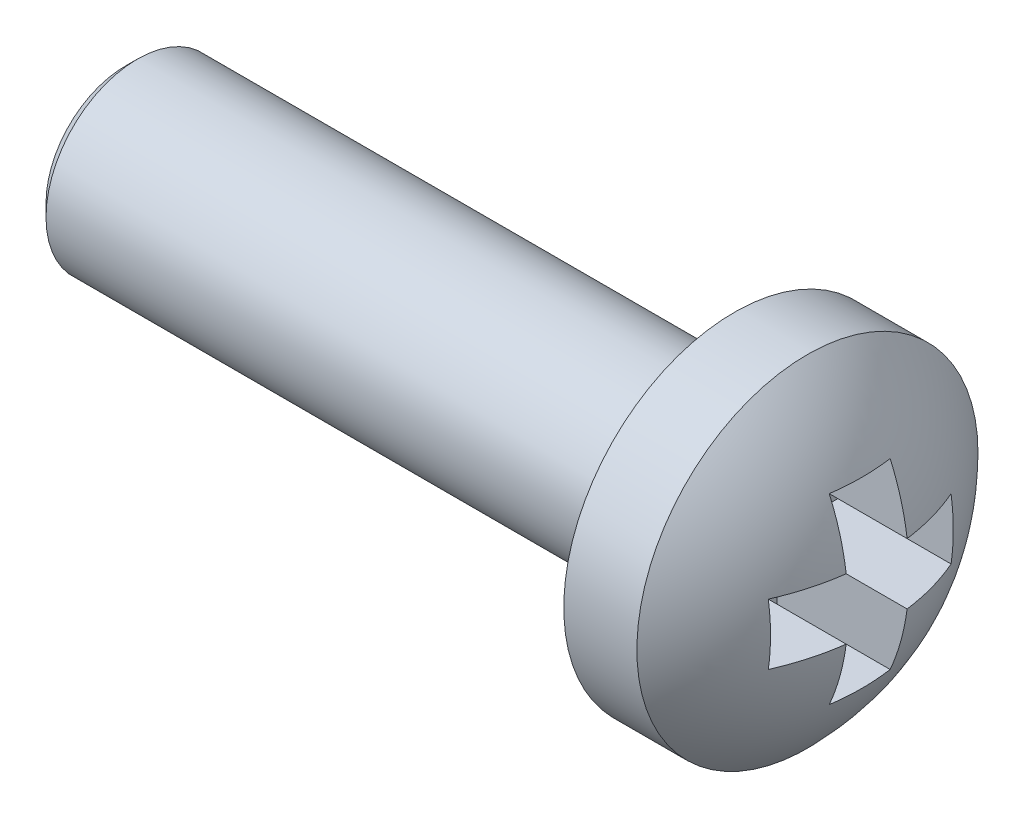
ISO-10303-21;
HEADER;
FILE_DESCRIPTION(('STEP AP214'),'2;1');
FILE_NAME('part.step','',(''),(''),'','','');
FILE_SCHEMA(('AUTOMOTIVE_DESIGN { 1 0 10303 214 1 1 1 1 }'));
ENDSEC;
DATA;
#1=APPLICATION_CONTEXT('core data for automotive mechanical design processes');
#2=APPLICATION_PROTOCOL_DEFINITION('international standard','automotive_design',2000,#1);
#3=PRODUCT_CONTEXT('',#1,'mechanical');
#4=PRODUCT('Part','Part','',(#3));
#5=PRODUCT_RELATED_PRODUCT_CATEGORY('part','',(#4));
#6=PRODUCT_DEFINITION_FORMATION('','',#4);
#7=PRODUCT_DEFINITION_CONTEXT('part definition',#1,'design');
#8=PRODUCT_DEFINITION('design','',#6,#7);
#9=PRODUCT_DEFINITION_SHAPE('','',#8);
#10=(LENGTH_UNIT() NAMED_UNIT(*) SI_UNIT(.MILLI.,.METRE.));
#11=(NAMED_UNIT(*) PLANE_ANGLE_UNIT() SI_UNIT($,.RADIAN.));
#12=(NAMED_UNIT(*) SI_UNIT($,.STERADIAN.) SOLID_ANGLE_UNIT());
#13=UNCERTAINTY_MEASURE_WITH_UNIT(LENGTH_MEASURE(1.E-05),#10,'distance_accuracy_value','');
#14=(GEOMETRIC_REPRESENTATION_CONTEXT(3) GLOBAL_UNCERTAINTY_ASSIGNED_CONTEXT((#13)) GLOBAL_UNIT_ASSIGNED_CONTEXT((#10,
#11,#12)) REPRESENTATION_CONTEXT('',''));
#15=CARTESIAN_POINT('',(0.,0.,0.));
#16=DIRECTION('',(0.,0.,1.));
#17=DIRECTION('',(1.,0.,0.));
#18=AXIS2_PLACEMENT_3D('',#15,#16,#17);
#19=CARTESIAN_POINT('',(2.4,0.,0.));
#20=CARTESIAN_POINT('',(2.4,-1.57169168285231,0.));
#21=CARTESIAN_POINT('',(1.2,-2.8,0.));
#22=B_SPLINE_CURVE_WITH_KNOTS('',2,(#19,#20,#21),.UNSPECIFIED.,.F.,.F.,(3,3),(0.,1.),.UNSPECIFIED.);
#23=CARTESIAN_POINT('',(11.0618266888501,0.,0.));
#24=DIRECTION('',(1.,0.,0.));
#25=AXIS1_PLACEMENT('',#23,#24);
#26=SURFACE_OF_REVOLUTION('',#22,#25);
#27=CARTESIAN_POINT('',(1.2,0.,0.));
#28=DIRECTION('',(1.,0.,0.));
#29=DIRECTION('',(0.,0.,-1.));
#30=AXIS2_PLACEMENT_3D('',#27,#28,#29);
#31=CIRCLE('',#30,2.8);
#32=CARTESIAN_POINT('',(1.2,0.,-2.8));
#33=VERTEX_POINT('',#32);
#34=EDGE_CURVE('E267',#33,#33,#31,.T.);
#35=ORIENTED_EDGE('',*,*,#34,.T.);
#36=EDGE_LOOP('',(#35));
#37=FACE_BOUND('',#36,.T.);
#38=CARTESIAN_POINT('',(2.05758661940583,0.500000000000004,1.49999999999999));
#39=CARTESIAN_POINT('',(2.08308448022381,0.500000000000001,1.44179657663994));
#40=CARTESIAN_POINT('',(2.10709470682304,0.5,1.38295700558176));
#41=CARTESIAN_POINT('',(2.1520554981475,0.5,1.26410705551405));
#42=CARTESIAN_POINT('',(2.17300544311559,0.5,1.204096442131));
#43=CARTESIAN_POINT('',(2.23082558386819,0.5,1.02342732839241));
#44=CARTESIAN_POINT('',(2.2630608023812,0.499999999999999,0.901232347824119));
#45=CARTESIAN_POINT('',(2.29852160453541,0.499999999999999,0.731861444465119));
#46=CARTESIAN_POINT('',(2.30725171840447,0.5,0.685768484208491));
#47=CARTESIAN_POINT('',(2.3229806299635,0.5,0.593159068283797));
#48=CARTESIAN_POINT('',(2.32997465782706,0.5,0.546641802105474));
#49=CARTESIAN_POINT('',(2.33609517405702,0.5,0.500000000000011));
#50=B_SPLINE_CURVE_WITH_KNOTS('',3,(#38,#39,#40,#41,#42,#43,#44,#45,#46,#47,#48,#49),
.UNSPECIFIED.,.F.,.F.,(4,2,2,2,2,4),(0.,0.190580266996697,0.381199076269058,0.759504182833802,
0.900218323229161,1.04131489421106),.UNSPECIFIED.);
#51=CARTESIAN_POINT('',(2.05758661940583,0.5,1.5));
#52=VERTEX_POINT('',#51);
#53=CARTESIAN_POINT('',(2.33609517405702,0.5,0.500000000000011));
#54=VERTEX_POINT('',#53);
#55=EDGE_CURVE('E169',#52,#54,#50,.T.);
#56=ORIENTED_EDGE('',*,*,#55,.T.);
#57=CARTESIAN_POINT('',(2.33609517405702,0.5,0.500000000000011));
#58=CARTESIAN_POINT('',(2.32797490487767,0.561927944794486,0.500000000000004));
#59=CARTESIAN_POINT('',(2.31830112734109,0.623654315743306,0.500000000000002));
#60=CARTESIAN_POINT('',(2.29584316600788,0.746540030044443,0.499999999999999));
#61=CARTESIAN_POINT('',(2.28305889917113,0.807699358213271,0.5));
#62=CARTESIAN_POINT('',(2.25447928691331,0.928850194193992,0.500000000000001));
#63=CARTESIAN_POINT('',(2.23870606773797,0.988846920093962,0.500000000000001));
#64=CARTESIAN_POINT('',(2.20412521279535,1.10795747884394,0.5));
#65=CARTESIAN_POINT('',(2.1853177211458,1.16707135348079,0.5));
#66=CARTESIAN_POINT('',(2.14895095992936,1.27208335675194,0.5));
#67=CARTESIAN_POINT('',(2.13194503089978,1.3181740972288,0.5));
#68=CARTESIAN_POINT('',(2.09611683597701,1.40963903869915,0.500000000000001));
#69=CARTESIAN_POINT('',(2.07729474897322,1.45501330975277,0.500000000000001));
#70=CARTESIAN_POINT('',(2.05758661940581,1.5,0.5));
#71=B_SPLINE_CURVE_WITH_KNOTS('',3,(#57,#58,#59,#60,#61,#62,#63,#64,#65,#66,#67,#68,#69,#70),
.UNSPECIFIED.,.F.,.F.,(4,2,2,2,2,2,4),(0.,0.187357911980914,0.374720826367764,0.560747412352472,
0.746765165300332,0.894111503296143,1.0414433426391),.UNSPECIFIED.);
#72=CARTESIAN_POINT('',(2.05758661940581,1.5,0.5));
#73=VERTEX_POINT('',#72);
#74=EDGE_CURVE('E11',#54,#73,#71,.T.);
#75=ORIENTED_EDGE('',*,*,#74,.T.);
#76=CARTESIAN_POINT('',(2.05758661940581,1.5,0.500000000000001));
#77=CARTESIAN_POINT('',(2.07601190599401,1.5,0.374107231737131));
#78=CARTESIAN_POINT('',(2.08741865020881,1.5,0.247173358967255));
#79=CARTESIAN_POINT('',(2.09618340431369,1.5,-0.00617564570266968));
#80=CARTESIAN_POINT('',(2.09365159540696,1.5,-0.132586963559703));
#81=CARTESIAN_POINT('',(2.07818848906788,1.5,-0.339263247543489));
#82=CARTESIAN_POINT('',(2.0693049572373,1.5,-0.419846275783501));
#83=CARTESIAN_POINT('',(2.05758661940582,1.5,-0.499999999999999));
#84=B_SPLINE_CURVE_WITH_KNOTS('',3,(#76,#77,#78,#79,#80,#81,#82,#83),.UNSPECIFIED.,.F.,.F.,(4,2,
2,4),(0.,0.381541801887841,0.760071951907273,1.00308018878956),.UNSPECIFIED.);
#85=CARTESIAN_POINT('',(2.05758661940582,1.5,-0.5));
#86=VERTEX_POINT('',#85);
#87=EDGE_CURVE('E47',#73,#86,#84,.T.);
#88=ORIENTED_EDGE('',*,*,#87,.T.);
#89=CARTESIAN_POINT('',(2.05758661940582,1.5,-0.499999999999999));
#90=CARTESIAN_POINT('',(2.08308448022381,1.44179657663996,-0.499999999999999));
#91=CARTESIAN_POINT('',(2.10709470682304,1.38295700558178,-0.5));
#92=CARTESIAN_POINT('',(2.1520554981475,1.26410705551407,-0.5));
#93=CARTESIAN_POINT('',(2.17300544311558,1.20409644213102,-0.5));
#94=CARTESIAN_POINT('',(2.23082558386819,1.02342732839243,-0.499999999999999));
#95=CARTESIAN_POINT('',(2.2630608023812,0.901232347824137,-0.499999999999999));
#96=CARTESIAN_POINT('',(2.29852160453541,0.731861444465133,-0.499999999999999));
#97=CARTESIAN_POINT('',(2.30725171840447,0.685768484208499,-0.499999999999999));
#98=CARTESIAN_POINT('',(2.3229806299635,0.593159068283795,-0.5));
#99=CARTESIAN_POINT('',(2.32997465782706,0.546641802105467,-0.5));
#100=CARTESIAN_POINT('',(2.33609517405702,0.5,-0.5));
#101=B_SPLINE_CURVE_WITH_KNOTS('',3,(#89,#90,#91,#92,#93,#94,#95,#96,#97,#98,#99,#100),
.UNSPECIFIED.,.F.,.F.,(4,2,2,2,2,4),(0.,0.190580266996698,0.381199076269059,0.759504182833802,
0.900218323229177,1.04131489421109),.UNSPECIFIED.);
#102=CARTESIAN_POINT('',(2.33609517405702,0.5,-0.5));
#103=VERTEX_POINT('',#102);
#104=EDGE_CURVE('E233',#86,#103,#101,.T.);
#105=ORIENTED_EDGE('',*,*,#104,.T.);
#106=CARTESIAN_POINT('',(2.33609517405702,0.5,-0.5));
#107=CARTESIAN_POINT('',(2.32797490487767,0.5,-0.561927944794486));
#108=CARTESIAN_POINT('',(2.31830112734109,0.5,-0.623654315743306));
#109=CARTESIAN_POINT('',(2.29584316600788,0.5,-0.746540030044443));
#110=CARTESIAN_POINT('',(2.28305889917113,0.5,-0.807699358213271));
#111=CARTESIAN_POINT('',(2.25447928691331,0.5,-0.928850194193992));
#112=CARTESIAN_POINT('',(2.23870606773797,0.5,-0.988846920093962));
#113=CARTESIAN_POINT('',(2.20412521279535,0.5,-1.10795747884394));
#114=CARTESIAN_POINT('',(2.1853177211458,0.5,-1.16707135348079));
#115=CARTESIAN_POINT('',(2.14895095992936,0.5,-1.27208335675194));
#116=CARTESIAN_POINT('',(2.13194503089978,0.5,-1.31817409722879));
#117=CARTESIAN_POINT('',(2.09611683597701,0.5,-1.40963903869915));
#118=CARTESIAN_POINT('',(2.07729474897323,0.5,-1.45501330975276));
#119=CARTESIAN_POINT('',(2.05758661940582,0.5,-1.49999999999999));
#120=B_SPLINE_CURVE_WITH_KNOTS('',3,(#106,#107,#108,#109,#110,#111,#112,#113,#114,#115,#116,
#117,#118,#119),.UNSPECIFIED.,.F.,.F.,(4,2,2,2,2,2,4),(0.,0.187357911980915,0.374720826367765,
0.560747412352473,0.746765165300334,0.894111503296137,1.04144334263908),.UNSPECIFIED.);
#121=CARTESIAN_POINT('',(2.05758661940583,0.5,-1.5));
#122=VERTEX_POINT('',#121);
#123=EDGE_CURVE('E227',#103,#122,#120,.T.);
#124=ORIENTED_EDGE('',*,*,#123,.T.);
#125=CARTESIAN_POINT('',(2.05758661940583,0.500000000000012,-1.49999999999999));
#126=CARTESIAN_POINT('',(2.07601190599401,0.374107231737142,-1.5));
#127=CARTESIAN_POINT('',(2.0874186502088,0.247173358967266,-1.5));
#128=CARTESIAN_POINT('',(2.09618340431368,-0.00617564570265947,-1.5));
#129=CARTESIAN_POINT('',(2.09365159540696,-0.132586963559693,-1.5));
#130=CARTESIAN_POINT('',(2.07818848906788,-0.339263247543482,-1.5));
#131=CARTESIAN_POINT('',(2.0693049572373,-0.419846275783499,-1.5));
#132=CARTESIAN_POINT('',(2.05758661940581,-0.500000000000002,-1.5));
#133=B_SPLINE_CURVE_WITH_KNOTS('',3,(#125,#126,#127,#128,#129,#130,#131,#132),.UNSPECIFIED.,.F.,
.F.,(4,2,2,4),(0.,0.38154180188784,0.760071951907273,1.00308018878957),.UNSPECIFIED.);
#134=CARTESIAN_POINT('',(2.05758661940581,-0.5,-1.5));
#135=VERTEX_POINT('',#134);
#136=EDGE_CURVE('E220',#122,#135,#133,.T.);
#137=ORIENTED_EDGE('',*,*,#136,.T.);
#138=CARTESIAN_POINT('',(2.05758661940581,-0.500000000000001,-1.5));
#139=CARTESIAN_POINT('',(2.0830844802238,-0.5,-1.44179657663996));
#140=CARTESIAN_POINT('',(2.10709470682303,-0.5,-1.38295700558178));
#141=CARTESIAN_POINT('',(2.1520554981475,-0.5,-1.26410705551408));
#142=CARTESIAN_POINT('',(2.17300544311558,-0.5,-1.20409644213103));
#143=CARTESIAN_POINT('',(2.23082558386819,-0.5,-1.02342732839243));
#144=CARTESIAN_POINT('',(2.2630608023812,-0.499999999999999,-0.901232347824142));
#145=CARTESIAN_POINT('',(2.29852160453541,-0.5,-0.731861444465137));
#146=CARTESIAN_POINT('',(2.30725171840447,-0.5,-0.685768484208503));
#147=CARTESIAN_POINT('',(2.3229806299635,-0.5,-0.593159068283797));
#148=CARTESIAN_POINT('',(2.32997465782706,-0.5,-0.546641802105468));
#149=CARTESIAN_POINT('',(2.33609517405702,-0.5,-0.5));
#150=B_SPLINE_CURVE_WITH_KNOTS('',3,(#138,#139,#140,#141,#142,#143,#144,#145,#146,#147,#148,
#149),.UNSPECIFIED.,.F.,.F.,(4,2,2,2,2,4),(0.,0.190580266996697,0.381199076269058,
0.759504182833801,0.900218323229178,1.0413148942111),.UNSPECIFIED.);
#151=CARTESIAN_POINT('',(2.33609517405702,-0.5,-0.5));
#152=VERTEX_POINT('',#151);
#153=EDGE_CURVE('E213',#135,#152,#150,.T.);
#154=ORIENTED_EDGE('',*,*,#153,.T.);
#155=CARTESIAN_POINT('',(2.33609517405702,-0.5,-0.5));
#156=CARTESIAN_POINT('',(2.32797490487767,-0.561927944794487,-0.5));
#157=CARTESIAN_POINT('',(2.31830112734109,-0.623654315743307,-0.5));
#158=CARTESIAN_POINT('',(2.29584316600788,-0.746540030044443,-0.5));
#159=CARTESIAN_POINT('',(2.28305889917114,-0.807699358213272,-0.5));
#160=CARTESIAN_POINT('',(2.25447928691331,-0.928850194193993,-0.5));
#161=CARTESIAN_POINT('',(2.23870606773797,-0.988846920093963,-0.5));
#162=CARTESIAN_POINT('',(2.20412521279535,-1.10795747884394,-0.5));
#163=CARTESIAN_POINT('',(2.1853177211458,-1.16707135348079,-0.5));
#164=CARTESIAN_POINT('',(2.14895095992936,-1.27208335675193,-0.5));
#165=CARTESIAN_POINT('',(2.13194503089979,-1.31817409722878,-0.5));
#166=CARTESIAN_POINT('',(2.09611683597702,-1.40963903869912,-0.499999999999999));
#167=CARTESIAN_POINT('',(2.07729474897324,-1.45501330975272,-0.499999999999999));
#168=CARTESIAN_POINT('',(2.05758661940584,-1.49999999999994,-0.499999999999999));
#169=B_SPLINE_CURVE_WITH_KNOTS('',3,(#155,#156,#157,#158,#159,#160,#161,#162,#163,#164,#165,
#166,#167,#168),.UNSPECIFIED.,.F.,.F.,(4,2,2,2,2,2,4),(0.,0.187357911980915,0.374720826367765,
0.560747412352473,0.746765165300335,0.894111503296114,1.04144334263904),.UNSPECIFIED.);
#170=CARTESIAN_POINT('',(2.05758661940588,-1.5,-0.5));
#171=VERTEX_POINT('',#170);
#172=EDGE_CURVE('E206',#152,#171,#169,.T.);
#173=ORIENTED_EDGE('',*,*,#172,.T.);
#174=CARTESIAN_POINT('',(2.05758661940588,-1.49999999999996,-0.499999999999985));
#175=CARTESIAN_POINT('',(2.07601190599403,-1.49999999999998,-0.374107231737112));
#176=CARTESIAN_POINT('',(2.08741865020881,-1.5,-0.247173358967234));
#177=CARTESIAN_POINT('',(2.09618340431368,-1.5,0.00617564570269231));
#178=CARTESIAN_POINT('',(2.09365159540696,-1.5,0.132586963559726));
#179=CARTESIAN_POINT('',(2.07818848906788,-1.5,0.339263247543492));
#180=CARTESIAN_POINT('',(2.06930495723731,-1.5,0.419846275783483));
#181=CARTESIAN_POINT('',(2.05758661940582,-1.5,0.499999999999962));
#182=B_SPLINE_CURVE_WITH_KNOTS('',3,(#174,#175,#176,#177,#178,#179,#180,#181),.UNSPECIFIED.,.F.,
.F.,(4,2,2,4),(0.,0.38154180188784,0.760071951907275,1.0030801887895),.UNSPECIFIED.);
#183=CARTESIAN_POINT('',(2.05758661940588,-1.5,0.5));
#184=VERTEX_POINT('',#183);
#185=EDGE_CURVE('E199',#171,#184,#182,.T.);
#186=ORIENTED_EDGE('',*,*,#185,.T.);
#187=CARTESIAN_POINT('',(2.05758661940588,-1.49999999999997,0.499999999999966));
#188=CARTESIAN_POINT('',(2.08308448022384,-1.44179657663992,0.499999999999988));
#189=CARTESIAN_POINT('',(2.10709470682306,-1.38295700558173,0.499999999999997));
#190=CARTESIAN_POINT('',(2.15205549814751,-1.26410705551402,0.500000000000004));
#191=CARTESIAN_POINT('',(2.1730054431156,-1.20409644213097,0.500000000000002));
#192=CARTESIAN_POINT('',(2.2308255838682,-1.02342732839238,0.499999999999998));
#193=CARTESIAN_POINT('',(2.26306080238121,-0.901232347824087,0.499999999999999));
#194=CARTESIAN_POINT('',(2.29852160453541,-0.73186144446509,0.5));
#195=CARTESIAN_POINT('',(2.30725171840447,-0.685768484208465,0.5));
#196=CARTESIAN_POINT('',(2.3229806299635,-0.593159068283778,0.500000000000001));
#197=CARTESIAN_POINT('',(2.32997465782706,-0.546641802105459,0.500000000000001));
#198=CARTESIAN_POINT('',(2.33609517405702,-0.5,0.5));
#199=B_SPLINE_CURVE_WITH_KNOTS('',3,(#187,#188,#189,#190,#191,#192,#193,#194,#195,#196,#197,
#198),.UNSPECIFIED.,.F.,.F.,(4,2,2,2,2,4),(0.,0.190580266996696,0.381199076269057,
0.759504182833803,0.900218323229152,1.04131489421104),.UNSPECIFIED.);
#200=CARTESIAN_POINT('',(2.33609517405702,-0.5,0.5));
#201=VERTEX_POINT('',#200);
#202=EDGE_CURVE('E192',#184,#201,#199,.T.);
#203=ORIENTED_EDGE('',*,*,#202,.T.);
#204=CARTESIAN_POINT('',(2.33609517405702,-0.5,0.5));
#205=CARTESIAN_POINT('',(2.32797490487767,-0.5,0.561927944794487));
#206=CARTESIAN_POINT('',(2.31830112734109,-0.5,0.623654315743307));
#207=CARTESIAN_POINT('',(2.29584316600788,-0.5,0.746540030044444));
#208=CARTESIAN_POINT('',(2.28305889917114,-0.5,0.807699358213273));
#209=CARTESIAN_POINT('',(2.25447928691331,-0.5,0.928850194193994));
#210=CARTESIAN_POINT('',(2.23870606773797,-0.5,0.988846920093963));
#211=CARTESIAN_POINT('',(2.20412521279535,-0.5,1.10795747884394));
#212=CARTESIAN_POINT('',(2.1853177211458,-0.500000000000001,1.16707135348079));
#213=CARTESIAN_POINT('',(2.14895095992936,-0.500000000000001,1.27208335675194));
#214=CARTESIAN_POINT('',(2.13194503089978,-0.5,1.3181740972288));
#215=CARTESIAN_POINT('',(2.09611683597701,-0.5,1.40963903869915));
#216=CARTESIAN_POINT('',(2.07729474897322,-0.5,1.45501330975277));
#217=CARTESIAN_POINT('',(2.05758661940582,-0.500000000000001,1.5));
#218=B_SPLINE_CURVE_WITH_KNOTS('',3,(#204,#205,#206,#207,#208,#209,#210,#211,#212,#213,#214,
#215,#216,#217),.UNSPECIFIED.,.F.,.F.,(4,2,2,2,2,2,4),(0.,0.187357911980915,0.374720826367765,
0.560747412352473,0.746765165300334,0.894111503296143,1.0414433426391),.UNSPECIFIED.);
#219=CARTESIAN_POINT('',(2.05758661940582,-0.5,1.5));
#220=VERTEX_POINT('',#219);
#221=EDGE_CURVE('E185',#201,#220,#218,.T.);
#222=ORIENTED_EDGE('',*,*,#221,.T.);
#223=CARTESIAN_POINT('',(2.05758661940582,-0.499999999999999,1.5));
#224=CARTESIAN_POINT('',(2.07601190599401,-0.374107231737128,1.5));
#225=CARTESIAN_POINT('',(2.0874186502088,-0.247173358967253,1.5));
#226=CARTESIAN_POINT('',(2.09618340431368,0.00617564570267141,1.5));
#227=CARTESIAN_POINT('',(2.09365159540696,0.132586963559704,1.5));
#228=CARTESIAN_POINT('',(2.07818848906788,0.339263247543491,1.5));
#229=CARTESIAN_POINT('',(2.0693049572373,0.419846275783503,1.5));
#230=CARTESIAN_POINT('',(2.05758661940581,0.500000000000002,1.5));
#231=B_SPLINE_CURVE_WITH_KNOTS('',3,(#223,#224,#225,#226,#227,#228,#229,#230),.UNSPECIFIED.,.F.,
.F.,(4,2,2,4),(0.,0.38154180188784,0.760071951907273,1.00308018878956),.UNSPECIFIED.);
#232=EDGE_CURVE('E178',#220,#52,#231,.T.);
#233=ORIENTED_EDGE('',*,*,#232,.T.);
#234=EDGE_LOOP('',(#56,#75,#88,#105,#124,#137,#154,#173,#186,#203,#222,#233));
#235=FACE_BOUND('',#234,.T.);
#236=ADVANCED_FACE('F35',(#37,#235),#26,.F.);
#237=CARTESIAN_POINT('',(11.0618266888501,0.,0.));
#238=DIRECTION('',(1.,0.,0.));
#239=DIRECTION('',(0.,0.,-1.));
#240=AXIS2_PLACEMENT_3D('',#237,#238,#239);
#241=CYLINDRICAL_SURFACE('',#240,2.8);
#242=CARTESIAN_POINT('',(0.,0.,0.));
#243=DIRECTION('',(1.,0.,0.));
#244=DIRECTION('',(0.,0.,-1.));
#245=AXIS2_PLACEMENT_3D('',#242,#243,#244);
#246=CIRCLE('',#245,2.8);
#247=CARTESIAN_POINT('',(0.,0.,-2.8));
#248=VERTEX_POINT('',#247);
#249=EDGE_CURVE('E147',#248,#248,#246,.T.);
#250=ORIENTED_EDGE('',*,*,#249,.T.);
#251=EDGE_LOOP('',(#250));
#252=FACE_BOUND('',#251,.T.);
#253=ORIENTED_EDGE('',*,*,#34,.F.);
#254=EDGE_LOOP('',(#253));
#255=FACE_BOUND('',#254,.T.);
#256=ADVANCED_FACE('F163',(#252,#255),#241,.T.);
#257=CARTESIAN_POINT('',(0.,-1.5,0.));
#258=DIRECTION('',(-1.,0.,0.));
#259=DIRECTION('',(0.,0.,1.));
#260=AXIS2_PLACEMENT_3D('',#257,#258,#259);
#261=PLANE('',#260);
#262=CARTESIAN_POINT('',(0.,0.,0.));
#263=DIRECTION('',(1.,0.,0.));
#264=DIRECTION('',(0.,0.,-1.));
#265=AXIS2_PLACEMENT_3D('',#262,#263,#264);
#266=CIRCLE('',#265,1.5);
#267=CARTESIAN_POINT('',(0.,0.,-1.5));
#268=VERTEX_POINT('',#267);
#269=EDGE_CURVE('E143',#268,#268,#266,.T.);
#270=ORIENTED_EDGE('',*,*,#269,.T.);
#271=EDGE_LOOP('',(#270));
#272=FACE_BOUND('',#271,.T.);
#273=ORIENTED_EDGE('',*,*,#249,.F.);
#274=EDGE_LOOP('',(#273));
#275=FACE_BOUND('',#274,.T.);
#276=ADVANCED_FACE('F255',(#272,#275),#261,.T.);
#277=CARTESIAN_POINT('',(11.0618266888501,0.,0.));
#278=DIRECTION('',(1.,0.,0.));
#279=DIRECTION('',(0.,0.,-1.));
#280=AXIS2_PLACEMENT_3D('',#277,#278,#279);
#281=CYLINDRICAL_SURFACE('',#280,1.5);
#282=CARTESIAN_POINT('',(-9.8,0.,0.));
#283=DIRECTION('',(-1.,0.,0.));
#284=DIRECTION('',(0.,0.,1.));
#285=AXIS2_PLACEMENT_3D('',#282,#283,#284);
#286=CIRCLE('',#285,1.5);
#287=CARTESIAN_POINT('',(-9.8,0.,1.5));
#288=VERTEX_POINT('',#287);
#289=EDGE_CURVE('E269',#288,#288,#286,.F.);
#290=ORIENTED_EDGE('',*,*,#289,.T.);
#291=EDGE_LOOP('',(#290));
#292=FACE_BOUND('',#291,.T.);
#293=ORIENTED_EDGE('',*,*,#269,.F.);
#294=EDGE_LOOP('',(#293));
#295=FACE_BOUND('',#294,.T.);
#296=ADVANCED_FACE('F252',(#292,#295),#281,.T.);
#297=CARTESIAN_POINT('',(-10.,-1.5,0.));
#298=DIRECTION('',(-1.,0.,0.));
#299=DIRECTION('',(0.,0.,1.));
#300=AXIS2_PLACEMENT_3D('',#297,#298,#299);
#301=PLANE('',#300);
#302=CARTESIAN_POINT('',(-10.,0.,0.));
#303=DIRECTION('',(-1.,0.,0.));
#304=DIRECTION('',(0.,0.,1.));
#305=AXIS2_PLACEMENT_3D('',#302,#303,#304);
#306=CIRCLE('',#305,1.3);
#307=CARTESIAN_POINT('',(-10.,0.,1.3));
#308=VERTEX_POINT('',#307);
#309=EDGE_CURVE('E273',#308,#308,#306,.T.);
#310=ORIENTED_EDGE('',*,*,#309,.T.);
#311=EDGE_LOOP('',(#310));
#312=FACE_BOUND('',#311,.T.);
#313=ADVANCED_FACE('F249',(#312),#301,.T.);
#314=CARTESIAN_POINT('',(-9.8,0.,0.));
#315=DIRECTION('',(1.,0.,0.));
#316=DIRECTION('',(0.,0.,-1.));
#317=AXIS2_PLACEMENT_3D('',#314,#315,#316);
#318=CONICAL_SURFACE('',#317,1.5,0.785398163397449);
#319=ORIENTED_EDGE('',*,*,#309,.F.);
#320=EDGE_LOOP('',(#319));
#321=FACE_BOUND('',#320,.T.);
#322=ORIENTED_EDGE('',*,*,#289,.F.);
#323=EDGE_LOOP('',(#322));
#324=FACE_BOUND('',#323,.T.);
#325=ADVANCED_FACE('F37',(#321,#324),#318,.T.);
#326=CARTESIAN_POINT('',(0.2,1.5,0.5));
#327=DIRECTION('',(0.,0.,-1.));
#328=DIRECTION('',(-1.,0.,0.));
#329=AXIS2_PLACEMENT_3D('',#326,#327,#328);
#330=PLANE('',#329);
#331=DIRECTION('',(1.,0.,0.));
#332=VECTOR('',#331,1.);
#333=CARTESIAN_POINT('',(0.2,0.5,0.5));
#334=LINE('',#333,#332);
#335=CARTESIAN_POINT('',(0.2,0.5,0.5));
#336=VERTEX_POINT('',#335);
#337=EDGE_CURVE('E54',#336,#54,#334,.T.);
#338=ORIENTED_EDGE('',*,*,#337,.F.);
#339=DIRECTION('',(0.,1.,0.));
#340=VECTOR('',#339,1.);
#341=CARTESIAN_POINT('',(0.2,1.5,0.5));
#342=LINE('',#341,#340);
#343=CARTESIAN_POINT('',(0.2,1.5,0.5));
#344=VERTEX_POINT('',#343);
#345=EDGE_CURVE('E133',#336,#344,#342,.T.);
#346=ORIENTED_EDGE('',*,*,#345,.T.);
#347=DIRECTION('',(1.,0.,0.));
#348=VECTOR('',#347,1.);
#349=CARTESIAN_POINT('',(0.2,1.5,0.5));
#350=LINE('',#349,#348);
#351=EDGE_CURVE('E140',#344,#73,#350,.T.);
#352=ORIENTED_EDGE('',*,*,#351,.T.);
#353=ORIENTED_EDGE('',*,*,#74,.F.);
#354=EDGE_LOOP('',(#338,#346,#352,#353));
#355=FACE_BOUND('',#354,.T.);
#356=ADVANCED_FACE('F139',(#355),#330,.T.);
#357=CARTESIAN_POINT('',(0.2,1.5,0.5));
#358=DIRECTION('',(0.,-1.,0.));
#359=DIRECTION('',(0.,0.,-1.));
#360=AXIS2_PLACEMENT_3D('',#357,#358,#359);
#361=PLANE('',#360);
#362=ORIENTED_EDGE('',*,*,#351,.F.);
#363=DIRECTION('',(0.,0.,-1.));
#364=VECTOR('',#363,1.);
#365=CARTESIAN_POINT('',(0.2,1.5,0.5));
#366=LINE('',#365,#364);
#367=CARTESIAN_POINT('',(0.2,1.5,-0.5));
#368=VERTEX_POINT('',#367);
#369=EDGE_CURVE('E129',#344,#368,#366,.T.);
#370=ORIENTED_EDGE('',*,*,#369,.T.);
#371=DIRECTION('',(1.,0.,0.));
#372=VECTOR('',#371,1.);
#373=CARTESIAN_POINT('',(0.2,1.5,-0.5));
#374=LINE('',#373,#372);
#375=EDGE_CURVE('E144',#368,#86,#374,.T.);
#376=ORIENTED_EDGE('',*,*,#375,.T.);
#377=ORIENTED_EDGE('',*,*,#87,.F.);
#378=EDGE_LOOP('',(#362,#370,#376,#377));
#379=FACE_BOUND('',#378,.T.);
#380=ADVANCED_FACE('F142',(#379),#361,.T.);
#381=CARTESIAN_POINT('',(0.2,1.5,-0.5));
#382=DIRECTION('',(0.,0.,1.));
#383=DIRECTION('',(1.,0.,0.));
#384=AXIS2_PLACEMENT_3D('',#381,#382,#383);
#385=PLANE('',#384);
#386=ORIENTED_EDGE('',*,*,#375,.F.);
#387=DIRECTION('',(0.,-1.,0.));
#388=VECTOR('',#387,1.);
#389=CARTESIAN_POINT('',(0.2,1.5,-0.5));
#390=LINE('',#389,#388);
#391=CARTESIAN_POINT('',(0.2,0.5,-0.5));
#392=VERTEX_POINT('',#391);
#393=EDGE_CURVE('E135',#368,#392,#390,.T.);
#394=ORIENTED_EDGE('',*,*,#393,.T.);
#395=DIRECTION('',(1.,0.,0.));
#396=VECTOR('',#395,1.);
#397=CARTESIAN_POINT('',(0.2,0.5,-0.5));
#398=LINE('',#397,#396);
#399=EDGE_CURVE('E149',#392,#103,#398,.T.);
#400=ORIENTED_EDGE('',*,*,#399,.T.);
#401=ORIENTED_EDGE('',*,*,#104,.F.);
#402=EDGE_LOOP('',(#386,#394,#400,#401));
#403=FACE_BOUND('',#402,.T.);
#404=ADVANCED_FACE('F244',(#403),#385,.T.);
#405=CARTESIAN_POINT('',(0.2,0.5,-0.5));
#406=DIRECTION('',(0.,-1.,0.));
#407=DIRECTION('',(0.,0.,-1.));
#408=AXIS2_PLACEMENT_3D('',#405,#406,#407);
#409=PLANE('',#408);
#410=ORIENTED_EDGE('',*,*,#399,.F.);
#411=DIRECTION('',(0.,0.,-1.));
#412=VECTOR('',#411,1.);
#413=CARTESIAN_POINT('',(0.2,0.5,-0.5));
#414=LINE('',#413,#412);
#415=CARTESIAN_POINT('',(0.2,0.5,-1.5));
#416=VERTEX_POINT('',#415);
#417=EDGE_CURVE('E333',#392,#416,#414,.T.);
#418=ORIENTED_EDGE('',*,*,#417,.T.);
#419=DIRECTION('',(1.,0.,0.));
#420=VECTOR('',#419,1.);
#421=CARTESIAN_POINT('',(0.2,0.5,-1.5));
#422=LINE('',#421,#420);
#423=EDGE_CURVE('E291',#416,#122,#422,.T.);
#424=ORIENTED_EDGE('',*,*,#423,.T.);
#425=ORIENTED_EDGE('',*,*,#123,.F.);
#426=EDGE_LOOP('',(#410,#418,#424,#425));
#427=FACE_BOUND('',#426,.T.);
#428=ADVANCED_FACE('F336',(#427),#409,.T.);
#429=CARTESIAN_POINT('',(0.2,0.5,-1.5));
#430=DIRECTION('',(0.,0.,1.));
#431=DIRECTION('',(1.,0.,0.));
#432=AXIS2_PLACEMENT_3D('',#429,#430,#431);
#433=PLANE('',#432);
#434=ORIENTED_EDGE('',*,*,#423,.F.);
#435=DIRECTION('',(0.,-1.,0.));
#436=VECTOR('',#435,1.);
#437=CARTESIAN_POINT('',(0.2,0.5,-1.5));
#438=LINE('',#437,#436);
#439=CARTESIAN_POINT('',(0.2,-0.5,-1.5));
#440=VERTEX_POINT('',#439);
#441=EDGE_CURVE('E331',#416,#440,#438,.T.);
#442=ORIENTED_EDGE('',*,*,#441,.T.);
#443=DIRECTION('',(1.,0.,0.));
#444=VECTOR('',#443,1.);
#445=CARTESIAN_POINT('',(0.2,-0.5,-1.5));
#446=LINE('',#445,#444);
#447=EDGE_CURVE('E293',#440,#135,#446,.T.);
#448=ORIENTED_EDGE('',*,*,#447,.T.);
#449=ORIENTED_EDGE('',*,*,#136,.F.);
#450=EDGE_LOOP('',(#434,#442,#448,#449));
#451=FACE_BOUND('',#450,.T.);
#452=ADVANCED_FACE('F339',(#451),#433,.T.);
#453=CARTESIAN_POINT('',(0.2,-0.5,-0.5));
#454=DIRECTION('',(0.,1.,0.));
#455=DIRECTION('',(0.,0.,1.));
#456=AXIS2_PLACEMENT_3D('',#453,#454,#455);
#457=PLANE('',#456);
#458=ORIENTED_EDGE('',*,*,#447,.F.);
#459=DIRECTION('',(0.,0.,1.));
#460=VECTOR('',#459,1.);
#461=CARTESIAN_POINT('',(0.2,-0.5,-0.5));
#462=LINE('',#461,#460);
#463=CARTESIAN_POINT('',(0.2,-0.5,-0.5));
#464=VERTEX_POINT('',#463);
#465=EDGE_CURVE('E329',#440,#464,#462,.T.);
#466=ORIENTED_EDGE('',*,*,#465,.T.);
#467=DIRECTION('',(1.,0.,0.));
#468=VECTOR('',#467,1.);
#469=CARTESIAN_POINT('',(0.2,-0.5,-0.5));
#470=LINE('',#469,#468);
#471=EDGE_CURVE('E298',#464,#152,#470,.T.);
#472=ORIENTED_EDGE('',*,*,#471,.T.);
#473=ORIENTED_EDGE('',*,*,#153,.F.);
#474=EDGE_LOOP('',(#458,#466,#472,#473));
#475=FACE_BOUND('',#474,.T.);
#476=ADVANCED_FACE('F346',(#475),#457,.T.);
#477=CARTESIAN_POINT('',(0.2,-0.5,-0.5));
#478=DIRECTION('',(0.,0.,1.));
#479=DIRECTION('',(0.,-1.,0.));
#480=AXIS2_PLACEMENT_3D('',#477,#478,#479);
#481=PLANE('',#480);
#482=ORIENTED_EDGE('',*,*,#471,.F.);
#483=DIRECTION('',(0.,-1.,0.));
#484=VECTOR('',#483,1.);
#485=CARTESIAN_POINT('',(0.2,-0.5,-0.5));
#486=LINE('',#485,#484);
#487=CARTESIAN_POINT('',(0.2,-1.5,-0.5));
#488=VERTEX_POINT('',#487);
#489=EDGE_CURVE('E327',#464,#488,#486,.T.);
#490=ORIENTED_EDGE('',*,*,#489,.T.);
#491=DIRECTION('',(1.,0.,0.));
#492=VECTOR('',#491,1.);
#493=CARTESIAN_POINT('',(0.2,-1.5,-0.5));
#494=LINE('',#493,#492);
#495=EDGE_CURVE('E301',#488,#171,#494,.T.);
#496=ORIENTED_EDGE('',*,*,#495,.T.);
#497=ORIENTED_EDGE('',*,*,#172,.F.);
#498=EDGE_LOOP('',(#482,#490,#496,#497));
#499=FACE_BOUND('',#498,.T.);
#500=ADVANCED_FACE('F348',(#499),#481,.T.);
#501=CARTESIAN_POINT('',(0.2,-1.5,0.5));
#502=DIRECTION('',(0.,1.,0.));
#503=DIRECTION('',(0.,0.,1.));
#504=AXIS2_PLACEMENT_3D('',#501,#502,#503);
#505=PLANE('',#504);
#506=ORIENTED_EDGE('',*,*,#495,.F.);
#507=DIRECTION('',(0.,0.,1.));
#508=VECTOR('',#507,1.);
#509=CARTESIAN_POINT('',(0.2,-1.5,0.5));
#510=LINE('',#509,#508);
#511=CARTESIAN_POINT('',(0.2,-1.5,0.5));
#512=VERTEX_POINT('',#511);
#513=EDGE_CURVE('E325',#488,#512,#510,.T.);
#514=ORIENTED_EDGE('',*,*,#513,.T.);
#515=DIRECTION('',(1.,0.,0.));
#516=VECTOR('',#515,1.);
#517=CARTESIAN_POINT('',(0.2,-1.5,0.5));
#518=LINE('',#517,#516);
#519=EDGE_CURVE('E304',#512,#184,#518,.T.);
#520=ORIENTED_EDGE('',*,*,#519,.T.);
#521=ORIENTED_EDGE('',*,*,#185,.F.);
#522=EDGE_LOOP('',(#506,#514,#520,#521));
#523=FACE_BOUND('',#522,.T.);
#524=ADVANCED_FACE('F351',(#523),#505,.T.);
#525=CARTESIAN_POINT('',(0.2,-0.5,0.5));
#526=DIRECTION('',(0.,0.,-1.));
#527=DIRECTION('',(-1.,0.,0.));
#528=AXIS2_PLACEMENT_3D('',#525,#526,#527);
#529=PLANE('',#528);
#530=ORIENTED_EDGE('',*,*,#519,.F.);
#531=DIRECTION('',(0.,1.,0.));
#532=VECTOR('',#531,1.);
#533=CARTESIAN_POINT('',(0.2,-0.5,0.5));
#534=LINE('',#533,#532);
#535=CARTESIAN_POINT('',(0.2,-0.5,0.5));
#536=VERTEX_POINT('',#535);
#537=EDGE_CURVE('E323',#512,#536,#534,.T.);
#538=ORIENTED_EDGE('',*,*,#537,.T.);
#539=DIRECTION('',(1.,0.,0.));
#540=VECTOR('',#539,1.);
#541=CARTESIAN_POINT('',(0.2,-0.5,0.5));
#542=LINE('',#541,#540);
#543=EDGE_CURVE('E307',#536,#201,#542,.T.);
#544=ORIENTED_EDGE('',*,*,#543,.T.);
#545=ORIENTED_EDGE('',*,*,#202,.F.);
#546=EDGE_LOOP('',(#530,#538,#544,#545));
#547=FACE_BOUND('',#546,.T.);
#548=ADVANCED_FACE('F358',(#547),#529,.T.);
#549=CARTESIAN_POINT('',(0.2,-0.5,1.5));
#550=DIRECTION('',(0.,1.,0.));
#551=DIRECTION('',(0.,0.,1.));
#552=AXIS2_PLACEMENT_3D('',#549,#550,#551);
#553=PLANE('',#552);
#554=ORIENTED_EDGE('',*,*,#543,.F.);
#555=DIRECTION('',(0.,0.,1.));
#556=VECTOR('',#555,1.);
#557=CARTESIAN_POINT('',(0.2,-0.5,1.5));
#558=LINE('',#557,#556);
#559=CARTESIAN_POINT('',(0.2,-0.5,1.5));
#560=VERTEX_POINT('',#559);
#561=EDGE_CURVE('E321',#536,#560,#558,.T.);
#562=ORIENTED_EDGE('',*,*,#561,.T.);
#563=DIRECTION('',(1.,0.,0.));
#564=VECTOR('',#563,1.);
#565=CARTESIAN_POINT('',(0.2,-0.5,1.5));
#566=LINE('',#565,#564);
#567=EDGE_CURVE('E310',#560,#220,#566,.T.);
#568=ORIENTED_EDGE('',*,*,#567,.T.);
#569=ORIENTED_EDGE('',*,*,#221,.F.);
#570=EDGE_LOOP('',(#554,#562,#568,#569));
#571=FACE_BOUND('',#570,.T.);
#572=ADVANCED_FACE('F360',(#571),#553,.T.);
#573=CARTESIAN_POINT('',(0.2,0.5,1.5));
#574=DIRECTION('',(0.,0.,-1.));
#575=DIRECTION('',(0.,1.,0.));
#576=AXIS2_PLACEMENT_3D('',#573,#574,#575);
#577=PLANE('',#576);
#578=ORIENTED_EDGE('',*,*,#567,.F.);
#579=DIRECTION('',(0.,1.,0.));
#580=VECTOR('',#579,1.);
#581=CARTESIAN_POINT('',(0.2,0.5,1.5));
#582=LINE('',#581,#580);
#583=CARTESIAN_POINT('',(0.2,0.5,1.5));
#584=VERTEX_POINT('',#583);
#585=EDGE_CURVE('E319',#560,#584,#582,.T.);
#586=ORIENTED_EDGE('',*,*,#585,.T.);
#587=DIRECTION('',(1.,0.,0.));
#588=VECTOR('',#587,1.);
#589=CARTESIAN_POINT('',(0.2,0.5,1.5));
#590=LINE('',#589,#588);
#591=EDGE_CURVE('E313',#584,#52,#590,.T.);
#592=ORIENTED_EDGE('',*,*,#591,.T.);
#593=ORIENTED_EDGE('',*,*,#232,.F.);
#594=EDGE_LOOP('',(#578,#586,#592,#593));
#595=FACE_BOUND('',#594,.T.);
#596=ADVANCED_FACE('F363',(#595),#577,.T.);
#597=CARTESIAN_POINT('',(0.2,0.5,1.5));
#598=DIRECTION('',(0.,-1.,0.));
#599=DIRECTION('',(0.,0.,-1.));
#600=AXIS2_PLACEMENT_3D('',#597,#598,#599);
#601=PLANE('',#600);
#602=ORIENTED_EDGE('',*,*,#591,.F.);
#603=DIRECTION('',(0.,0.,-1.));
#604=VECTOR('',#603,1.);
#605=CARTESIAN_POINT('',(0.2,0.5,1.5));
#606=LINE('',#605,#604);
#607=EDGE_CURVE('E317',#584,#336,#606,.T.);
#608=ORIENTED_EDGE('',*,*,#607,.T.);
#609=ORIENTED_EDGE('',*,*,#337,.T.);
#610=ORIENTED_EDGE('',*,*,#55,.F.);
#611=EDGE_LOOP('',(#602,#608,#609,#610));
#612=FACE_BOUND('',#611,.T.);
#613=ADVANCED_FACE('F365',(#612),#601,.T.);
#614=CARTESIAN_POINT('',(0.2,0.5,0.5));
#615=DIRECTION('',(1.,0.,0.));
#616=DIRECTION('',(0.,0.,-1.));
#617=AXIS2_PLACEMENT_3D('',#614,#615,#616);
#618=PLANE('',#617);
#619=ORIENTED_EDGE('',*,*,#345,.F.);
#620=ORIENTED_EDGE('',*,*,#607,.F.);
#621=ORIENTED_EDGE('',*,*,#585,.F.);
#622=ORIENTED_EDGE('',*,*,#561,.F.);
#623=ORIENTED_EDGE('',*,*,#537,.F.);
#624=ORIENTED_EDGE('',*,*,#513,.F.);
#625=ORIENTED_EDGE('',*,*,#489,.F.);
#626=ORIENTED_EDGE('',*,*,#465,.F.);
#627=ORIENTED_EDGE('',*,*,#441,.F.);
#628=ORIENTED_EDGE('',*,*,#417,.F.);
#629=ORIENTED_EDGE('',*,*,#393,.F.);
#630=ORIENTED_EDGE('',*,*,#369,.F.);
#631=EDGE_LOOP('',(#619,#620,#621,#622,#623,#624,#625,#626,#627,#628,#629,#630));
#632=FACE_BOUND('',#631,.T.);
#633=ADVANCED_FACE('F131',(#632),#618,.T.);
#634=CLOSED_SHELL('',(#236,#256,#276,#296,#313,#325,#356,#380,#404,#428,#452,#476,#500,#524,
#548,#572,#596,#613,#633));
#635=MANIFOLD_SOLID_BREP('B2',#634);
#636=ADVANCED_BREP_SHAPE_REPRESENTATION('',(#18,#635),#14);
#637=SHAPE_DEFINITION_REPRESENTATION(#9,#636);
ENDSEC;
END-ISO-10303-21;
